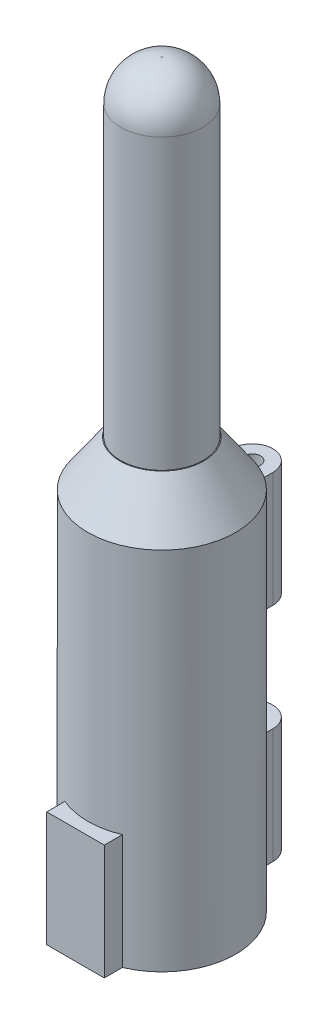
ISO-10303-21;
HEADER;
FILE_DESCRIPTION(('STEP AP214'),'2;1');
FILE_NAME('part.step','',(''),(''),'','','');
FILE_SCHEMA(('AUTOMOTIVE_DESIGN { 1 0 10303 214 1 1 1 1 }'));
ENDSEC;
DATA;
#1=APPLICATION_CONTEXT('core data for automotive mechanical design processes');
#2=APPLICATION_PROTOCOL_DEFINITION('international standard','automotive_design',2000,#1);
#3=PRODUCT_CONTEXT('',#1,'mechanical');
#4=PRODUCT('Part','Part','',(#3));
#5=PRODUCT_RELATED_PRODUCT_CATEGORY('part','',(#4));
#6=PRODUCT_DEFINITION_FORMATION('','',#4);
#7=PRODUCT_DEFINITION_CONTEXT('part definition',#1,'design');
#8=PRODUCT_DEFINITION('design','',#6,#7);
#9=PRODUCT_DEFINITION_SHAPE('','',#8);
#10=(LENGTH_UNIT() NAMED_UNIT(*) SI_UNIT(.MILLI.,.METRE.));
#11=(NAMED_UNIT(*) PLANE_ANGLE_UNIT() SI_UNIT($,.RADIAN.));
#12=(NAMED_UNIT(*) SI_UNIT($,.STERADIAN.) SOLID_ANGLE_UNIT());
#13=UNCERTAINTY_MEASURE_WITH_UNIT(LENGTH_MEASURE(1.E-05),#10,'distance_accuracy_value','');
#14=(GEOMETRIC_REPRESENTATION_CONTEXT(3) GLOBAL_UNCERTAINTY_ASSIGNED_CONTEXT((#13)) GLOBAL_UNIT_ASSIGNED_CONTEXT((#10,
#11,#12)) REPRESENTATION_CONTEXT('',''));
#15=CARTESIAN_POINT('',(0.,0.,0.));
#16=DIRECTION('',(0.,0.,1.));
#17=DIRECTION('',(1.,0.,0.));
#18=AXIS2_PLACEMENT_3D('',#15,#16,#17);
#19=CARTESIAN_POINT('',(0.,0.,-7.30000000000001));
#20=DIRECTION('',(0.,1.,0.));
#21=DIRECTION('',(0.,0.,1.));
#22=AXIS2_PLACEMENT_3D('',#19,#20,#21);
#23=PLANE('',#22);
#24=CARTESIAN_POINT('',(0.,0.,0.));
#25=DIRECTION('',(0.,-1.,0.));
#26=DIRECTION('',(0.,0.,-1.));
#27=AXIS2_PLACEMENT_3D('',#24,#25,#26);
#28=CIRCLE('',#27,7.5);
#29=CARTESIAN_POINT('',(0.,0.,-7.5));
#30=VERTEX_POINT('',#29);
#31=EDGE_CURVE('E620',#30,#30,#28,.T.);
#32=ORIENTED_EDGE('',*,*,#31,.F.);
#33=EDGE_LOOP('',(#32));
#34=FACE_BOUND('',#33,.T.);
#35=CARTESIAN_POINT('',(0.,0.,0.));
#36=DIRECTION('',(0.,1.,0.));
#37=DIRECTION('',(0.,0.,1.));
#38=AXIS2_PLACEMENT_3D('',#35,#36,#37);
#39=CIRCLE('',#38,9.00000000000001);
#40=CARTESIAN_POINT('',(3.5,0.,8.2915619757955));
#41=VERTEX_POINT('',#40);
#42=CARTESIAN_POINT('',(-3.5,0.,8.29156197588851));
#43=VERTEX_POINT('',#42);
#44=EDGE_CURVE('E244',#41,#43,#39,.T.);
#45=ORIENTED_EDGE('',*,*,#44,.F.);
#46=DIRECTION('',(0.,0.,1.));
#47=VECTOR('',#46,1.);
#48=CARTESIAN_POINT('',(3.5,0.,-500000.));
#49=LINE('',#48,#47);
#50=CARTESIAN_POINT('',(3.5,0.,10.5));
#51=VERTEX_POINT('',#50);
#52=EDGE_CURVE('E225',#41,#51,#49,.T.);
#53=ORIENTED_EDGE('',*,*,#52,.T.);
#54=DIRECTION('',(1.,0.,0.));
#55=VECTOR('',#54,1.);
#56=CARTESIAN_POINT('',(-3.5,0.,10.5));
#57=LINE('',#56,#55);
#58=CARTESIAN_POINT('',(-3.5,0.,10.5));
#59=VERTEX_POINT('',#58);
#60=EDGE_CURVE('E206',#59,#51,#57,.T.);
#61=ORIENTED_EDGE('',*,*,#60,.F.);
#62=DIRECTION('',(0.,0.,1.));
#63=VECTOR('',#62,1.);
#64=CARTESIAN_POINT('',(-3.5,0.,-500000.));
#65=LINE('',#64,#63);
#66=EDGE_CURVE('E227',#43,#59,#65,.T.);
#67=ORIENTED_EDGE('',*,*,#66,.F.);
#68=EDGE_LOOP('',(#45,#53,#61,#67));
#69=FACE_BOUND('',#68,.T.);
#70=ADVANCED_FACE('F33',(#34,#69),#23,.F.);
#71=CARTESIAN_POINT('',(0.,90.,0.));
#72=DIRECTION('',(0.,1.,0.));
#73=DIRECTION('',(0.,0.,1.));
#74=AXIS2_PLACEMENT_3D('',#71,#72,#73);
#75=CYLINDRICAL_SURFACE('',#74,9.00000000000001);
#76=DIRECTION('',(0.,-1.,0.));
#77=VECTOR('',#76,1.);
#78=CARTESIAN_POINT('',(2.5,42.,-8.6458082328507));
#79=LINE('',#78,#77);
#80=CARTESIAN_POINT('',(2.5,42.,-8.6458082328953));
#81=VERTEX_POINT('',#80);
#82=CARTESIAN_POINT('',(2.5000000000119,28.,-8.64580823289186));
#83=VERTEX_POINT('',#82);
#84=EDGE_CURVE('E49',#81,#83,#79,.T.);
#85=ORIENTED_EDGE('',*,*,#84,.F.);
#86=CARTESIAN_POINT('',(0.,42.,0.));
#87=DIRECTION('',(0.,1.,0.));
#88=DIRECTION('',(0.,0.,1.));
#89=AXIS2_PLACEMENT_3D('',#86,#87,#88);
#90=CIRCLE('',#89,8.99999999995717);
#91=CARTESIAN_POINT('',(-2.5,42.,-8.6458082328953));
#92=VERTEX_POINT('',#91);
#93=EDGE_CURVE('E54',#81,#92,#90,.T.);
#94=ORIENTED_EDGE('',*,*,#93,.T.);
#95=DIRECTION('',(0.,-1.,0.));
#96=VECTOR('',#95,1.);
#97=CARTESIAN_POINT('',(-2.5,42.,-8.6458082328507));
#98=LINE('',#97,#96);
#99=CARTESIAN_POINT('',(-2.5,28.,-8.6458082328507));
#100=VERTEX_POINT('',#99);
#101=EDGE_CURVE('E160',#92,#100,#98,.T.);
#102=ORIENTED_EDGE('',*,*,#101,.T.);
#103=CARTESIAN_POINT('',(0.,28.,0.));
#104=DIRECTION('',(0.,1.,0.));
#105=DIRECTION('',(0.,0.,1.));
#106=AXIS2_PLACEMENT_3D('',#103,#104,#105);
#107=CIRCLE('',#106,8.99999999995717);
#108=EDGE_CURVE('E143',#83,#100,#107,.T.);
#109=ORIENTED_EDGE('',*,*,#108,.F.);
#110=EDGE_LOOP('',(#85,#94,#102,#109));
#111=FACE_BOUND('',#110,.T.);
#112=DIRECTION('',(0.,-1.,0.));
#113=VECTOR('',#112,1.);
#114=CARTESIAN_POINT('',(2.5,15.,-8.6458082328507));
#115=LINE('',#114,#113);
#116=CARTESIAN_POINT('',(2.5,15.,-8.6458082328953));
#117=VERTEX_POINT('',#116);
#118=CARTESIAN_POINT('',(2.5000000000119,1.,-8.64580823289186));
#119=VERTEX_POINT('',#118);
#120=EDGE_CURVE('E199',#117,#119,#115,.T.);
#121=ORIENTED_EDGE('',*,*,#120,.F.);
#122=CARTESIAN_POINT('',(0.,15.,0.));
#123=DIRECTION('',(0.,1.,0.));
#124=DIRECTION('',(0.,0.,1.));
#125=AXIS2_PLACEMENT_3D('',#122,#123,#124);
#126=CIRCLE('',#125,8.99999999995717);
#127=CARTESIAN_POINT('',(-2.5,15.,-8.6458082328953));
#128=VERTEX_POINT('',#127);
#129=EDGE_CURVE('E182',#117,#128,#126,.T.);
#130=ORIENTED_EDGE('',*,*,#129,.T.);
#131=DIRECTION('',(0.,-1.,0.));
#132=VECTOR('',#131,1.);
#133=CARTESIAN_POINT('',(-2.5,15.,-8.6458082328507));
#134=LINE('',#133,#132);
#135=CARTESIAN_POINT('',(-2.5,1.,-8.6458082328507));
#136=VERTEX_POINT('',#135);
#137=EDGE_CURVE('E192',#128,#136,#134,.T.);
#138=ORIENTED_EDGE('',*,*,#137,.T.);
#139=CARTESIAN_POINT('',(0.,1.,0.));
#140=DIRECTION('',(0.,1.,0.));
#141=DIRECTION('',(0.,0.,1.));
#142=AXIS2_PLACEMENT_3D('',#139,#140,#141);
#143=CIRCLE('',#142,8.99999999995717);
#144=EDGE_CURVE('E167',#119,#136,#143,.T.);
#145=ORIENTED_EDGE('',*,*,#144,.F.);
#146=EDGE_LOOP('',(#121,#130,#138,#145));
#147=FACE_BOUND('',#146,.T.);
#148=ORIENTED_EDGE('',*,*,#44,.T.);
#149=DIRECTION('',(0.,1.,0.));
#150=VECTOR('',#149,1.);
#151=CARTESIAN_POINT('',(-3.50000000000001,90.,8.2915619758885));
#152=LINE('',#151,#150);
#153=CARTESIAN_POINT('',(-3.5,14.,8.29156197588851));
#154=VERTEX_POINT('',#153);
#155=EDGE_CURVE('E202',#154,#43,#152,.F.);
#156=ORIENTED_EDGE('',*,*,#155,.F.);
#157=CARTESIAN_POINT('',(0.,14.,0.));
#158=DIRECTION('',(0.,1.,0.));
#159=DIRECTION('',(0.,0.,1.));
#160=AXIS2_PLACEMENT_3D('',#157,#158,#159);
#161=CIRCLE('',#160,9.00000000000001);
#162=CARTESIAN_POINT('',(3.5,14.,8.29156197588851));
#163=VERTEX_POINT('',#162);
#164=EDGE_CURVE('E220',#163,#154,#161,.F.);
#165=ORIENTED_EDGE('',*,*,#164,.F.);
#166=DIRECTION('',(0.,1.,0.));
#167=VECTOR('',#166,1.);
#168=CARTESIAN_POINT('',(3.49999999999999,90.,8.29156197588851));
#169=LINE('',#168,#167);
#170=EDGE_CURVE('E217',#41,#163,#169,.T.);
#171=ORIENTED_EDGE('',*,*,#170,.F.);
#172=EDGE_LOOP('',(#148,#156,#165,#171));
#173=FACE_BOUND('',#172,.T.);
#174=CARTESIAN_POINT('',(0.,44.4302227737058,0.));
#175=DIRECTION('',(0.,1.,0.));
#176=DIRECTION('',(0.,0.,1.));
#177=AXIS2_PLACEMENT_3D('',#174,#175,#176);
#178=CIRCLE('',#177,9.00000000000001);
#179=CARTESIAN_POINT('',(0.,44.4302227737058,9.00000000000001));
#180=VERTEX_POINT('',#179);
#181=EDGE_CURVE('E241',#180,#180,#178,.T.);
#182=ORIENTED_EDGE('',*,*,#181,.F.);
#183=EDGE_LOOP('',(#182));
#184=FACE_BOUND('',#183,.T.);
#185=ADVANCED_FACE('F275',(#111,#147,#173,#184),#75,.T.);
#186=CARTESIAN_POINT('',(0.,44.4302227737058,0.));
#187=DIRECTION('',(0.,-1.,0.));
#188=DIRECTION('',(0.,0.,-1.));
#189=AXIS2_PLACEMENT_3D('',#186,#187,#188);
#190=CONICAL_SURFACE('',#189,9.00000000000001,0.610865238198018);
#191=CARTESIAN_POINT('',(0.,50.,0.));
#192=DIRECTION('',(0.,1.,0.));
#193=DIRECTION('',(0.,0.,1.));
#194=AXIS2_PLACEMENT_3D('',#191,#192,#193);
#195=CIRCLE('',#194,5.10000000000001);
#196=CARTESIAN_POINT('',(0.,50.,5.10000000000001));
#197=VERTEX_POINT('',#196);
#198=EDGE_CURVE('E238',#197,#197,#195,.T.);
#199=ORIENTED_EDGE('',*,*,#198,.F.);
#200=EDGE_LOOP('',(#199));
#201=FACE_BOUND('',#200,.T.);
#202=ORIENTED_EDGE('',*,*,#181,.T.);
#203=EDGE_LOOP('',(#202));
#204=FACE_BOUND('',#203,.T.);
#205=ADVANCED_FACE('F281',(#201,#204),#190,.T.);
#206=CARTESIAN_POINT('',(0.,50.,-5.10000000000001));
#207=DIRECTION('',(0.,-1.,0.));
#208=DIRECTION('',(0.,0.,-1.));
#209=AXIS2_PLACEMENT_3D('',#206,#207,#208);
#210=PLANE('',#209);
#211=CARTESIAN_POINT('',(0.,50.,0.));
#212=DIRECTION('',(0.,1.,0.));
#213=DIRECTION('',(0.,0.,1.));
#214=AXIS2_PLACEMENT_3D('',#211,#212,#213);
#215=CIRCLE('',#214,5.00000000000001);
#216=CARTESIAN_POINT('',(0.,50.,5.00000000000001));
#217=VERTEX_POINT('',#216);
#218=EDGE_CURVE('E235',#217,#217,#215,.T.);
#219=ORIENTED_EDGE('',*,*,#218,.F.);
#220=EDGE_LOOP('',(#219));
#221=FACE_BOUND('',#220,.T.);
#222=ORIENTED_EDGE('',*,*,#198,.T.);
#223=EDGE_LOOP('',(#222));
#224=FACE_BOUND('',#223,.T.);
#225=ADVANCED_FACE('F537',(#221,#224),#210,.F.);
#226=CARTESIAN_POINT('',(0.,90.,0.));
#227=DIRECTION('',(0.,1.,0.));
#228=DIRECTION('',(0.,0.,1.));
#229=AXIS2_PLACEMENT_3D('',#226,#227,#228);
#230=CYLINDRICAL_SURFACE('',#229,5.00000000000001);
#231=CARTESIAN_POINT('',(0.,85.1,0.));
#232=DIRECTION('',(0.,1.,0.));
#233=DIRECTION('',(0.,0.,1.));
#234=AXIS2_PLACEMENT_3D('',#231,#232,#233);
#235=CIRCLE('',#234,5.00000000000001);
#236=CARTESIAN_POINT('',(0.,85.1,5.00000000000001));
#237=VERTEX_POINT('',#236);
#238=EDGE_CURVE('E232',#237,#237,#235,.T.);
#239=ORIENTED_EDGE('',*,*,#238,.F.);
#240=EDGE_LOOP('',(#239));
#241=FACE_BOUND('',#240,.T.);
#242=ORIENTED_EDGE('',*,*,#218,.T.);
#243=EDGE_LOOP('',(#242));
#244=FACE_BOUND('',#243,.T.);
#245=ADVANCED_FACE('F527',(#241,#244),#230,.T.);
#246=CARTESIAN_POINT('',(0.,85.1,0.));
#247=DIRECTION('',(0.,1.,0.));
#248=DIRECTION('',(0.,0.,1.));
#249=AXIS2_PLACEMENT_3D('',#246,#247,#248);
#250=DEGENERATE_TOROIDAL_SURFACE('',#249,0.100000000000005,4.9,.T.);
#251=CARTESIAN_POINT('',(0.,90.,0.));
#252=DIRECTION('',(0.,1.,0.));
#253=DIRECTION('',(0.,0.,1.));
#254=AXIS2_PLACEMENT_3D('',#251,#252,#253);
#255=CIRCLE('',#254,0.0999999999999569);
#256=CARTESIAN_POINT('',(0.,90.,0.0999999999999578));
#257=VERTEX_POINT('',#256);
#258=EDGE_CURVE('E214',#257,#257,#255,.T.);
#259=ORIENTED_EDGE('',*,*,#258,.F.);
#260=EDGE_LOOP('',(#259));
#261=FACE_BOUND('',#260,.T.);
#262=ORIENTED_EDGE('',*,*,#238,.T.);
#263=EDGE_LOOP('',(#262));
#264=FACE_BOUND('',#263,.T.);
#265=ADVANCED_FACE('F517',(#261,#264),#250,.T.);
#266=CARTESIAN_POINT('',(0.,90.,-0.099999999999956));
#267=DIRECTION('',(0.,-1.,0.));
#268=DIRECTION('',(0.,0.,-1.));
#269=AXIS2_PLACEMENT_3D('',#266,#267,#268);
#270=PLANE('',#269);
#271=ORIENTED_EDGE('',*,*,#258,.T.);
#272=EDGE_LOOP('',(#271));
#273=FACE_BOUND('',#272,.T.);
#274=ADVANCED_FACE('F483',(#273),#270,.F.);
#275=CARTESIAN_POINT('',(-3.5,0.,10.5));
#276=DIRECTION('',(0.,0.,1.));
#277=DIRECTION('',(1.,0.,0.));
#278=AXIS2_PLACEMENT_3D('',#275,#276,#277);
#279=PLANE('',#278);
#280=DIRECTION('',(0.,-1.,0.));
#281=VECTOR('',#280,1.);
#282=CARTESIAN_POINT('',(-3.5,14.,10.5));
#283=LINE('',#282,#281);
#284=CARTESIAN_POINT('',(-3.5,14.,10.5));
#285=VERTEX_POINT('',#284);
#286=EDGE_CURVE('E211',#285,#59,#283,.T.);
#287=ORIENTED_EDGE('',*,*,#286,.T.);
#288=ORIENTED_EDGE('',*,*,#60,.T.);
#289=DIRECTION('',(0.,1.,0.));
#290=VECTOR('',#289,1.);
#291=CARTESIAN_POINT('',(3.5,14.,10.5));
#292=LINE('',#291,#290);
#293=CARTESIAN_POINT('',(3.5,14.,10.5));
#294=VERTEX_POINT('',#293);
#295=EDGE_CURVE('E203',#51,#294,#292,.T.);
#296=ORIENTED_EDGE('',*,*,#295,.T.);
#297=DIRECTION('',(-1.,0.,0.));
#298=VECTOR('',#297,1.);
#299=CARTESIAN_POINT('',(-3.5,14.,10.5));
#300=LINE('',#299,#298);
#301=EDGE_CURVE('E207',#294,#285,#300,.T.);
#302=ORIENTED_EDGE('',*,*,#301,.T.);
#303=EDGE_LOOP('',(#287,#288,#296,#302));
#304=FACE_BOUND('',#303,.T.);
#305=ADVANCED_FACE('F472',(#304),#279,.T.);
#306=CARTESIAN_POINT('',(-3.5,14.,-500000.));
#307=DIRECTION('',(-1.,0.,0.));
#308=DIRECTION('',(0.,-1.,0.));
#309=AXIS2_PLACEMENT_3D('',#306,#307,#308);
#310=PLANE('',#309);
#311=DIRECTION('',(0.,0.,1.));
#312=VECTOR('',#311,1.);
#313=CARTESIAN_POINT('',(-3.5,14.,-500000.));
#314=LINE('',#313,#312);
#315=EDGE_CURVE('E210',#154,#285,#314,.T.);
#316=ORIENTED_EDGE('',*,*,#315,.F.);
#317=ORIENTED_EDGE('',*,*,#155,.T.);
#318=ORIENTED_EDGE('',*,*,#66,.T.);
#319=ORIENTED_EDGE('',*,*,#286,.F.);
#320=EDGE_LOOP('',(#316,#317,#318,#319));
#321=FACE_BOUND('',#320,.T.);
#322=ADVANCED_FACE('F491',(#321),#310,.T.);
#323=CARTESIAN_POINT('',(3.5,14.,-500000.));
#324=DIRECTION('',(1.,0.,0.));
#325=DIRECTION('',(0.,1.,0.));
#326=AXIS2_PLACEMENT_3D('',#323,#324,#325);
#327=PLANE('',#326);
#328=ORIENTED_EDGE('',*,*,#52,.F.);
#329=ORIENTED_EDGE('',*,*,#170,.T.);
#330=DIRECTION('',(0.,0.,1.));
#331=VECTOR('',#330,1.);
#332=CARTESIAN_POINT('',(3.5,14.,-500000.));
#333=LINE('',#332,#331);
#334=EDGE_CURVE('E223',#163,#294,#333,.T.);
#335=ORIENTED_EDGE('',*,*,#334,.T.);
#336=ORIENTED_EDGE('',*,*,#295,.F.);
#337=EDGE_LOOP('',(#328,#329,#335,#336));
#338=FACE_BOUND('',#337,.T.);
#339=ADVANCED_FACE('F480',(#338),#327,.T.);
#340=CARTESIAN_POINT('',(-3.5,14.,-500000.));
#341=DIRECTION('',(0.,1.,0.));
#342=DIRECTION('',(0.,0.,1.));
#343=AXIS2_PLACEMENT_3D('',#340,#341,#342);
#344=PLANE('',#343);
#345=ORIENTED_EDGE('',*,*,#334,.F.);
#346=ORIENTED_EDGE('',*,*,#164,.T.);
#347=ORIENTED_EDGE('',*,*,#315,.T.);
#348=ORIENTED_EDGE('',*,*,#301,.F.);
#349=EDGE_LOOP('',(#345,#346,#347,#348));
#350=FACE_BOUND('',#349,.T.);
#351=ADVANCED_FACE('F469',(#350),#344,.T.);
#352=CARTESIAN_POINT('',(2.5,15.,-11.0690059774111));
#353=DIRECTION('',(-1.,0.,0.));
#354=DIRECTION('',(0.,0.,1.));
#355=AXIS2_PLACEMENT_3D('',#352,#353,#354);
#356=PLANE('',#355);
#357=DIRECTION('',(0.,0.,-1.));
#358=VECTOR('',#357,1.);
#359=CARTESIAN_POINT('',(2.5,1.,-11.0690059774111));
#360=LINE('',#359,#358);
#361=CARTESIAN_POINT('',(2.5,1.,-11.));
#362=VERTEX_POINT('',#361);
#363=EDGE_CURVE('E170',#119,#362,#360,.T.);
#364=ORIENTED_EDGE('',*,*,#363,.T.);
#365=DIRECTION('',(0.,-1.,0.));
#366=VECTOR('',#365,1.);
#367=CARTESIAN_POINT('',(2.5,15.,-11.));
#368=LINE('',#367,#366);
#369=CARTESIAN_POINT('',(2.5,15.,-11.));
#370=VERTEX_POINT('',#369);
#371=EDGE_CURVE('E196',#370,#362,#368,.T.);
#372=ORIENTED_EDGE('',*,*,#371,.F.);
#373=DIRECTION('',(0.,0.,-1.));
#374=VECTOR('',#373,1.);
#375=CARTESIAN_POINT('',(2.5,15.,-11.0690059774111));
#376=LINE('',#375,#374);
#377=EDGE_CURVE('E184',#117,#370,#376,.T.);
#378=ORIENTED_EDGE('',*,*,#377,.F.);
#379=ORIENTED_EDGE('',*,*,#120,.T.);
#380=EDGE_LOOP('',(#364,#372,#378,#379));
#381=FACE_BOUND('',#380,.T.);
#382=ADVANCED_FACE('F459',(#381),#356,.F.);
#383=CARTESIAN_POINT('',(0.,15.,-11.));
#384=DIRECTION('',(0.,-1.,0.));
#385=DIRECTION('',(0.,0.,-1.));
#386=AXIS2_PLACEMENT_3D('',#383,#384,#385);
#387=CYLINDRICAL_SURFACE('',#386,2.5);
#388=CARTESIAN_POINT('',(0.,1.,-11.));
#389=DIRECTION('',(0.,1.,0.));
#390=DIRECTION('',(0.,0.,1.));
#391=AXIS2_PLACEMENT_3D('',#388,#389,#390);
#392=CIRCLE('',#391,2.5);
#393=CARTESIAN_POINT('',(-2.5,1.,-11.));
#394=VERTEX_POINT('',#393);
#395=EDGE_CURVE('E173',#362,#394,#392,.T.);
#396=ORIENTED_EDGE('',*,*,#395,.T.);
#397=DIRECTION('',(0.,-1.,0.));
#398=VECTOR('',#397,1.);
#399=CARTESIAN_POINT('',(-2.5,15.,-11.));
#400=LINE('',#399,#398);
#401=CARTESIAN_POINT('',(-2.5,15.,-11.));
#402=VERTEX_POINT('',#401);
#403=EDGE_CURVE('E194',#402,#394,#400,.T.);
#404=ORIENTED_EDGE('',*,*,#403,.F.);
#405=CARTESIAN_POINT('',(0.,15.,-11.));
#406=DIRECTION('',(0.,1.,0.));
#407=DIRECTION('',(0.,0.,1.));
#408=AXIS2_PLACEMENT_3D('',#405,#406,#407);
#409=CIRCLE('',#408,2.5);
#410=EDGE_CURVE('E187',#370,#402,#409,.T.);
#411=ORIENTED_EDGE('',*,*,#410,.F.);
#412=ORIENTED_EDGE('',*,*,#371,.T.);
#413=EDGE_LOOP('',(#396,#404,#411,#412));
#414=FACE_BOUND('',#413,.T.);
#415=ADVANCED_FACE('F449',(#414),#387,.T.);
#416=CARTESIAN_POINT('',(0.,15.,-11.));
#417=DIRECTION('',(0.,-1.,0.));
#418=DIRECTION('',(0.,0.,-1.));
#419=AXIS2_PLACEMENT_3D('',#416,#417,#418);
#420=CYLINDRICAL_SURFACE('',#419,1.);
#421=CARTESIAN_POINT('',(0.,15.,-11.));
#422=DIRECTION('',(0.,1.,0.));
#423=DIRECTION('',(0.,0.,1.));
#424=AXIS2_PLACEMENT_3D('',#421,#422,#423);
#425=CIRCLE('',#424,1.);
#426=CARTESIAN_POINT('',(0.,15.,-10.));
#427=VERTEX_POINT('',#426);
#428=EDGE_CURVE('E179',#427,#427,#425,.T.);
#429=ORIENTED_EDGE('',*,*,#428,.T.);
#430=EDGE_LOOP('',(#429));
#431=FACE_BOUND('',#430,.T.);
#432=CARTESIAN_POINT('',(0.,1.,-11.));
#433=DIRECTION('',(0.,1.,0.));
#434=DIRECTION('',(0.,0.,1.));
#435=AXIS2_PLACEMENT_3D('',#432,#433,#434);
#436=CIRCLE('',#435,1.);
#437=CARTESIAN_POINT('',(0.,1.,-10.));
#438=VERTEX_POINT('',#437);
#439=EDGE_CURVE('E164',#438,#438,#436,.T.);
#440=ORIENTED_EDGE('',*,*,#439,.F.);
#441=EDGE_LOOP('',(#440));
#442=FACE_BOUND('',#441,.T.);
#443=ADVANCED_FACE('F439',(#431,#442),#420,.F.);
#444=CARTESIAN_POINT('',(-2.5,15.,-11.0690059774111));
#445=DIRECTION('',(-1.,0.,0.));
#446=DIRECTION('',(0.,0.,1.));
#447=AXIS2_PLACEMENT_3D('',#444,#445,#446);
#448=PLANE('',#447);
#449=DIRECTION('',(0.,0.,-1.));
#450=VECTOR('',#449,1.);
#451=CARTESIAN_POINT('',(-2.5,1.,-11.0690059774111));
#452=LINE('',#451,#450);
#453=EDGE_CURVE('E176',#136,#394,#452,.T.);
#454=ORIENTED_EDGE('',*,*,#453,.F.);
#455=ORIENTED_EDGE('',*,*,#137,.F.);
#456=DIRECTION('',(0.,0.,-1.));
#457=VECTOR('',#456,1.);
#458=CARTESIAN_POINT('',(-2.5,15.,-11.0690059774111));
#459=LINE('',#458,#457);
#460=EDGE_CURVE('E189',#128,#402,#459,.T.);
#461=ORIENTED_EDGE('',*,*,#460,.T.);
#462=ORIENTED_EDGE('',*,*,#403,.T.);
#463=EDGE_LOOP('',(#454,#455,#461,#462));
#464=FACE_BOUND('',#463,.T.);
#465=ADVANCED_FACE('F428',(#464),#448,.T.);
#466=CARTESIAN_POINT('',(-5.59441665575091,15.,-11.0690059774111));
#467=DIRECTION('',(0.,1.,0.));
#468=DIRECTION('',(0.,0.,1.));
#469=AXIS2_PLACEMENT_3D('',#466,#467,#468);
#470=PLANE('',#469);
#471=ORIENTED_EDGE('',*,*,#428,.F.);
#472=EDGE_LOOP('',(#471));
#473=FACE_BOUND('',#472,.T.);
#474=ORIENTED_EDGE('',*,*,#129,.F.);
#475=ORIENTED_EDGE('',*,*,#377,.T.);
#476=ORIENTED_EDGE('',*,*,#410,.T.);
#477=ORIENTED_EDGE('',*,*,#460,.F.);
#478=EDGE_LOOP('',(#474,#475,#476,#477));
#479=FACE_BOUND('',#478,.T.);
#480=ADVANCED_FACE('F417',(#473,#479),#470,.T.);
#481=CARTESIAN_POINT('',(-5.59441665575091,1.,-11.0690059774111));
#482=DIRECTION('',(0.,1.,0.));
#483=DIRECTION('',(0.,0.,1.));
#484=AXIS2_PLACEMENT_3D('',#481,#482,#483);
#485=PLANE('',#484);
#486=ORIENTED_EDGE('',*,*,#439,.T.);
#487=EDGE_LOOP('',(#486));
#488=FACE_BOUND('',#487,.T.);
#489=ORIENTED_EDGE('',*,*,#144,.T.);
#490=ORIENTED_EDGE('',*,*,#453,.T.);
#491=ORIENTED_EDGE('',*,*,#395,.F.);
#492=ORIENTED_EDGE('',*,*,#363,.F.);
#493=EDGE_LOOP('',(#489,#490,#491,#492));
#494=FACE_BOUND('',#493,.T.);
#495=ADVANCED_FACE('F400',(#488,#494),#485,.F.);
#496=CARTESIAN_POINT('',(2.5,42.,-11.0690059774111));
#497=DIRECTION('',(-1.,0.,0.));
#498=DIRECTION('',(0.,0.,1.));
#499=AXIS2_PLACEMENT_3D('',#496,#497,#498);
#500=PLANE('',#499);
#501=DIRECTION('',(0.,0.,-1.));
#502=VECTOR('',#501,1.);
#503=CARTESIAN_POINT('',(2.5,28.,-11.0690059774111));
#504=LINE('',#503,#502);
#505=CARTESIAN_POINT('',(2.5,28.,-11.));
#506=VERTEX_POINT('',#505);
#507=EDGE_CURVE('E128',#83,#506,#504,.T.);
#508=ORIENTED_EDGE('',*,*,#507,.T.);
#509=DIRECTION('',(0.,-1.,0.));
#510=VECTOR('',#509,1.);
#511=CARTESIAN_POINT('',(2.5,42.,-11.));
#512=LINE('',#511,#510);
#513=CARTESIAN_POINT('',(2.5,42.,-11.));
#514=VERTEX_POINT('',#513);
#515=EDGE_CURVE('E135',#514,#506,#512,.T.);
#516=ORIENTED_EDGE('',*,*,#515,.F.);
#517=DIRECTION('',(0.,0.,-1.));
#518=VECTOR('',#517,1.);
#519=CARTESIAN_POINT('',(2.5,42.,-11.0690059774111));
#520=LINE('',#519,#518);
#521=EDGE_CURVE('E154',#81,#514,#520,.T.);
#522=ORIENTED_EDGE('',*,*,#521,.F.);
#523=ORIENTED_EDGE('',*,*,#84,.T.);
#524=EDGE_LOOP('',(#508,#516,#522,#523));
#525=FACE_BOUND('',#524,.T.);
#526=ADVANCED_FACE('F142',(#525),#500,.F.);
#527=CARTESIAN_POINT('',(0.,42.,-11.));
#528=DIRECTION('',(0.,-1.,0.));
#529=DIRECTION('',(0.,0.,-1.));
#530=AXIS2_PLACEMENT_3D('',#527,#528,#529);
#531=CYLINDRICAL_SURFACE('',#530,2.5);
#532=CARTESIAN_POINT('',(0.,28.,-11.));
#533=DIRECTION('',(0.,1.,0.));
#534=DIRECTION('',(0.,0.,1.));
#535=AXIS2_PLACEMENT_3D('',#532,#533,#534);
#536=CIRCLE('',#535,2.5);
#537=CARTESIAN_POINT('',(-2.5,28.,-11.));
#538=VERTEX_POINT('',#537);
#539=EDGE_CURVE('E123',#506,#538,#536,.T.);
#540=ORIENTED_EDGE('',*,*,#539,.T.);
#541=DIRECTION('',(0.,-1.,0.));
#542=VECTOR('',#541,1.);
#543=CARTESIAN_POINT('',(-2.5,42.,-11.));
#544=LINE('',#543,#542);
#545=CARTESIAN_POINT('',(-2.5,42.,-11.));
#546=VERTEX_POINT('',#545);
#547=EDGE_CURVE('E140',#546,#538,#544,.T.);
#548=ORIENTED_EDGE('',*,*,#547,.F.);
#549=CARTESIAN_POINT('',(0.,42.,-11.));
#550=DIRECTION('',(0.,1.,0.));
#551=DIRECTION('',(0.,0.,1.));
#552=AXIS2_PLACEMENT_3D('',#549,#550,#551);
#553=CIRCLE('',#552,2.5);
#554=EDGE_CURVE('E137',#514,#546,#553,.T.);
#555=ORIENTED_EDGE('',*,*,#554,.F.);
#556=ORIENTED_EDGE('',*,*,#515,.T.);
#557=EDGE_LOOP('',(#540,#548,#555,#556));
#558=FACE_BOUND('',#557,.T.);
#559=ADVANCED_FACE('F136',(#558),#531,.T.);
#560=CARTESIAN_POINT('',(0.,42.,-11.));
#561=DIRECTION('',(0.,-1.,0.));
#562=DIRECTION('',(0.,0.,-1.));
#563=AXIS2_PLACEMENT_3D('',#560,#561,#562);
#564=CYLINDRICAL_SURFACE('',#563,1.);
#565=CARTESIAN_POINT('',(0.,42.,-11.));
#566=DIRECTION('',(0.,1.,0.));
#567=DIRECTION('',(0.,0.,1.));
#568=AXIS2_PLACEMENT_3D('',#565,#566,#567);
#569=CIRCLE('',#568,1.);
#570=CARTESIAN_POINT('',(0.,42.,-10.));
#571=VERTEX_POINT('',#570);
#572=EDGE_CURVE('E150',#571,#571,#569,.T.);
#573=ORIENTED_EDGE('',*,*,#572,.T.);
#574=EDGE_LOOP('',(#573));
#575=FACE_BOUND('',#574,.T.);
#576=CARTESIAN_POINT('',(0.,28.,-11.));
#577=DIRECTION('',(0.,1.,0.));
#578=DIRECTION('',(0.,0.,1.));
#579=AXIS2_PLACEMENT_3D('',#576,#577,#578);
#580=CIRCLE('',#579,1.);
#581=CARTESIAN_POINT('',(0.,28.,-10.));
#582=VERTEX_POINT('',#581);
#583=EDGE_CURVE('E145',#582,#582,#580,.T.);
#584=ORIENTED_EDGE('',*,*,#583,.F.);
#585=EDGE_LOOP('',(#584));
#586=FACE_BOUND('',#585,.T.);
#587=ADVANCED_FACE('F373',(#575,#586),#564,.F.);
#588=CARTESIAN_POINT('',(-2.5,42.,-11.0690059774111));
#589=DIRECTION('',(-1.,0.,0.));
#590=DIRECTION('',(0.,0.,1.));
#591=AXIS2_PLACEMENT_3D('',#588,#589,#590);
#592=PLANE('',#591);
#593=DIRECTION('',(0.,0.,-1.));
#594=VECTOR('',#593,1.);
#595=CARTESIAN_POINT('',(-2.5,28.,-11.0690059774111));
#596=LINE('',#595,#594);
#597=EDGE_CURVE('E130',#100,#538,#596,.T.);
#598=ORIENTED_EDGE('',*,*,#597,.F.);
#599=ORIENTED_EDGE('',*,*,#101,.F.);
#600=DIRECTION('',(0.,0.,-1.));
#601=VECTOR('',#600,1.);
#602=CARTESIAN_POINT('',(-2.5,42.,-11.0690059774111));
#603=LINE('',#602,#601);
#604=EDGE_CURVE('E157',#92,#546,#603,.T.);
#605=ORIENTED_EDGE('',*,*,#604,.T.);
#606=ORIENTED_EDGE('',*,*,#547,.T.);
#607=EDGE_LOOP('',(#598,#599,#605,#606));
#608=FACE_BOUND('',#607,.T.);
#609=ADVANCED_FACE('F362',(#608),#592,.T.);
#610=CARTESIAN_POINT('',(-5.59441665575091,42.,-11.0690059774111));
#611=DIRECTION('',(0.,1.,0.));
#612=DIRECTION('',(0.,0.,1.));
#613=AXIS2_PLACEMENT_3D('',#610,#611,#612);
#614=PLANE('',#613);
#615=ORIENTED_EDGE('',*,*,#572,.F.);
#616=EDGE_LOOP('',(#615));
#617=FACE_BOUND('',#616,.T.);
#618=ORIENTED_EDGE('',*,*,#93,.F.);
#619=ORIENTED_EDGE('',*,*,#521,.T.);
#620=ORIENTED_EDGE('',*,*,#554,.T.);
#621=ORIENTED_EDGE('',*,*,#604,.F.);
#622=EDGE_LOOP('',(#618,#619,#620,#621));
#623=FACE_BOUND('',#622,.T.);
#624=ADVANCED_FACE('F351',(#617,#623),#614,.T.);
#625=CARTESIAN_POINT('',(-5.59441665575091,28.,-11.0690059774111));
#626=DIRECTION('',(0.,1.,0.));
#627=DIRECTION('',(0.,0.,1.));
#628=AXIS2_PLACEMENT_3D('',#625,#626,#627);
#629=PLANE('',#628);
#630=ORIENTED_EDGE('',*,*,#583,.T.);
#631=EDGE_LOOP('',(#630));
#632=FACE_BOUND('',#631,.T.);
#633=ORIENTED_EDGE('',*,*,#108,.T.);
#634=ORIENTED_EDGE('',*,*,#597,.T.);
#635=ORIENTED_EDGE('',*,*,#539,.F.);
#636=ORIENTED_EDGE('',*,*,#507,.F.);
#637=EDGE_LOOP('',(#633,#634,#635,#636));
#638=FACE_BOUND('',#637,.T.);
#639=ADVANCED_FACE('F126',(#632,#638),#629,.F.);
#640=CARTESIAN_POINT('',(0.,37.,0.));
#641=DIRECTION('',(0.,-1.,0.));
#642=DIRECTION('',(0.,0.,-1.));
#643=AXIS2_PLACEMENT_3D('',#640,#641,#642);
#644=PLANE('',#643);
#645=CARTESIAN_POINT('',(0.,37.,0.));
#646=DIRECTION('',(0.,-1.,0.));
#647=DIRECTION('',(0.,0.,-1.));
#648=AXIS2_PLACEMENT_3D('',#645,#646,#647);
#649=CIRCLE('',#648,7.5);
#650=CARTESIAN_POINT('',(0.,37.,-7.5));
#651=VERTEX_POINT('',#650);
#652=EDGE_CURVE('E616',#651,#651,#649,.T.);
#653=ORIENTED_EDGE('',*,*,#652,.T.);
#654=EDGE_LOOP('',(#653));
#655=FACE_BOUND('',#654,.T.);
#656=CARTESIAN_POINT('',(0.,37.,0.));
#657=DIRECTION('',(0.,-1.,0.));
#658=DIRECTION('',(0.,0.,-1.));
#659=AXIS2_PLACEMENT_3D('',#656,#657,#658);
#660=CIRCLE('',#659,7.30000000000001);
#661=CARTESIAN_POINT('',(0.,37.,-7.30000000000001));
#662=VERTEX_POINT('',#661);
#663=EDGE_CURVE('E37',#662,#662,#660,.F.);
#664=ORIENTED_EDGE('',*,*,#663,.T.);
#665=EDGE_LOOP('',(#664));
#666=FACE_BOUND('',#665,.T.);
#667=ADVANCED_FACE('F271',(#655,#666),#644,.T.);
#668=CARTESIAN_POINT('',(0.,37.,0.));
#669=DIRECTION('',(0.,-1.,0.));
#670=DIRECTION('',(0.,0.,-1.));
#671=AXIS2_PLACEMENT_3D('',#668,#669,#670);
#672=CYLINDRICAL_SURFACE('',#671,7.5);
#673=ORIENTED_EDGE('',*,*,#652,.F.);
#674=EDGE_LOOP('',(#673));
#675=FACE_BOUND('',#674,.T.);
#676=ORIENTED_EDGE('',*,*,#31,.T.);
#677=EDGE_LOOP('',(#676));
#678=FACE_BOUND('',#677,.T.);
#679=ADVANCED_FACE('F267',(#675,#678),#672,.F.);
#680=CARTESIAN_POINT('',(0.,88.3,-0.0999999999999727));
#681=DIRECTION('',(0.,1.,0.));
#682=DIRECTION('',(0.,0.,1.));
#683=AXIS2_PLACEMENT_3D('',#680,#681,#682);
#684=PLANE('',#683);
#685=CARTESIAN_POINT('',(0.,88.3,0.));
#686=DIRECTION('',(0.,1.,0.));
#687=DIRECTION('',(0.,0.,1.));
#688=AXIS2_PLACEMENT_3D('',#685,#686,#687);
#689=CIRCLE('',#688,0.0999999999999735);
#690=CARTESIAN_POINT('',(0.,88.3,0.0999999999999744));
#691=VERTEX_POINT('',#690);
#692=EDGE_CURVE('E11',#691,#691,#689,.T.);
#693=ORIENTED_EDGE('',*,*,#692,.F.);
#694=EDGE_LOOP('',(#693));
#695=FACE_BOUND('',#694,.T.);
#696=ADVANCED_FACE('F35',(#695),#684,.F.);
#697=CARTESIAN_POINT('',(0.,85.1,0.));
#698=DIRECTION('',(0.,1.,0.));
#699=DIRECTION('',(0.,0.,1.));
#700=AXIS2_PLACEMENT_3D('',#697,#698,#699);
#701=DEGENERATE_TOROIDAL_SURFACE('',#700,0.100000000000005,3.2,.T.);
#702=CARTESIAN_POINT('',(0.,85.1,0.));
#703=DIRECTION('',(0.,1.,0.));
#704=DIRECTION('',(0.,0.,1.));
#705=AXIS2_PLACEMENT_3D('',#702,#703,#704);
#706=CIRCLE('',#705,3.30000000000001);
#707=CARTESIAN_POINT('',(0.,85.1,3.30000000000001));
#708=VERTEX_POINT('',#707);
#709=EDGE_CURVE('E42',#708,#708,#706,.T.);
#710=ORIENTED_EDGE('',*,*,#709,.F.);
#711=EDGE_LOOP('',(#710));
#712=FACE_BOUND('',#711,.T.);
#713=ORIENTED_EDGE('',*,*,#692,.T.);
#714=EDGE_LOOP('',(#713));
#715=FACE_BOUND('',#714,.T.);
#716=ADVANCED_FACE('F261',(#712,#715),#701,.F.);
#717=CARTESIAN_POINT('',(0.,90.,0.));
#718=DIRECTION('',(0.,1.,0.));
#719=DIRECTION('',(0.,0.,1.));
#720=AXIS2_PLACEMENT_3D('',#717,#718,#719);
#721=CYLINDRICAL_SURFACE('',#720,3.30000000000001);
#722=CARTESIAN_POINT('',(0.,48.3,0.));
#723=DIRECTION('',(0.,1.,0.));
#724=DIRECTION('',(0.,0.,1.));
#725=AXIS2_PLACEMENT_3D('',#722,#723,#724);
#726=CIRCLE('',#725,3.3);
#727=CARTESIAN_POINT('',(0.,48.3,3.30000000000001));
#728=VERTEX_POINT('',#727);
#729=EDGE_CURVE('E253',#728,#728,#726,.T.);
#730=ORIENTED_EDGE('',*,*,#729,.F.);
#731=EDGE_LOOP('',(#730));
#732=FACE_BOUND('',#731,.T.);
#733=ORIENTED_EDGE('',*,*,#709,.T.);
#734=EDGE_LOOP('',(#733));
#735=FACE_BOUND('',#734,.T.);
#736=ADVANCED_FACE('F259',(#732,#735),#721,.F.);
#737=CARTESIAN_POINT('',(0.,48.3,-4.21503601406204));
#738=DIRECTION('',(0.,1.,0.));
#739=DIRECTION('',(0.,0.,1.));
#740=AXIS2_PLACEMENT_3D('',#737,#738,#739);
#741=PLANE('',#740);
#742=CARTESIAN_POINT('',(0.,48.3,0.));
#743=DIRECTION('',(0.,1.,0.));
#744=DIRECTION('',(0.,0.,1.));
#745=AXIS2_PLACEMENT_3D('',#742,#743,#744);
#746=CIRCLE('',#745,4.21503601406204);
#747=CARTESIAN_POINT('',(0.,48.3,4.21503601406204));
#748=VERTEX_POINT('',#747);
#749=EDGE_CURVE('E250',#748,#748,#746,.T.);
#750=ORIENTED_EDGE('',*,*,#749,.F.);
#751=EDGE_LOOP('',(#750));
#752=FACE_BOUND('',#751,.T.);
#753=ORIENTED_EDGE('',*,*,#729,.T.);
#754=EDGE_LOOP('',(#753));
#755=FACE_BOUND('',#754,.T.);
#756=ADVANCED_FACE('F294',(#752,#755),#741,.F.);
#757=CARTESIAN_POINT('',(0.,48.3,0.));
#758=DIRECTION('',(0.,-1.,0.));
#759=DIRECTION('',(0.,0.,-1.));
#760=AXIS2_PLACEMENT_3D('',#757,#758,#759);
#761=CONICAL_SURFACE('',#760,4.21503601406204,0.610865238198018);
#762=CARTESIAN_POINT('',(0.,43.8942148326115,0.));
#763=DIRECTION('',(0.,1.,0.));
#764=DIRECTION('',(0.,0.,1.));
#765=AXIS2_PLACEMENT_3D('',#762,#763,#764);
#766=CIRCLE('',#765,7.30000000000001);
#767=CARTESIAN_POINT('',(0.,43.8942148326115,7.30000000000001));
#768=VERTEX_POINT('',#767);
#769=EDGE_CURVE('E247',#768,#768,#766,.T.);
#770=ORIENTED_EDGE('',*,*,#769,.F.);
#771=EDGE_LOOP('',(#770));
#772=FACE_BOUND('',#771,.T.);
#773=ORIENTED_EDGE('',*,*,#749,.T.);
#774=EDGE_LOOP('',(#773));
#775=FACE_BOUND('',#774,.T.);
#776=ADVANCED_FACE('F290',(#772,#775),#761,.F.);
#777=CARTESIAN_POINT('',(0.,90.,0.));
#778=DIRECTION('',(0.,1.,0.));
#779=DIRECTION('',(0.,0.,1.));
#780=AXIS2_PLACEMENT_3D('',#777,#778,#779);
#781=CYLINDRICAL_SURFACE('',#780,7.30000000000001);
#782=ORIENTED_EDGE('',*,*,#769,.T.);
#783=EDGE_LOOP('',(#782));
#784=FACE_BOUND('',#783,.T.);
#785=ORIENTED_EDGE('',*,*,#663,.F.);
#786=EDGE_LOOP('',(#785));
#787=FACE_BOUND('',#786,.T.);
#788=ADVANCED_FACE('F287',(#784,#787),#781,.F.);
#789=CLOSED_SHELL('',(#70,#185,#205,#225,#245,#265,#274,#305,#322,#339,#351,#382,#415,#443,#465,
#480,#495,#526,#559,#587,#609,#624,#639,#667,#679,#696,#716,#736,#756,#776,#788));
#790=MANIFOLD_SOLID_BREP('B2',#789);
#791=ADVANCED_BREP_SHAPE_REPRESENTATION('',(#18,#790),#14);
#792=SHAPE_DEFINITION_REPRESENTATION(#9,#791);
ENDSEC;
END-ISO-10303-21;
